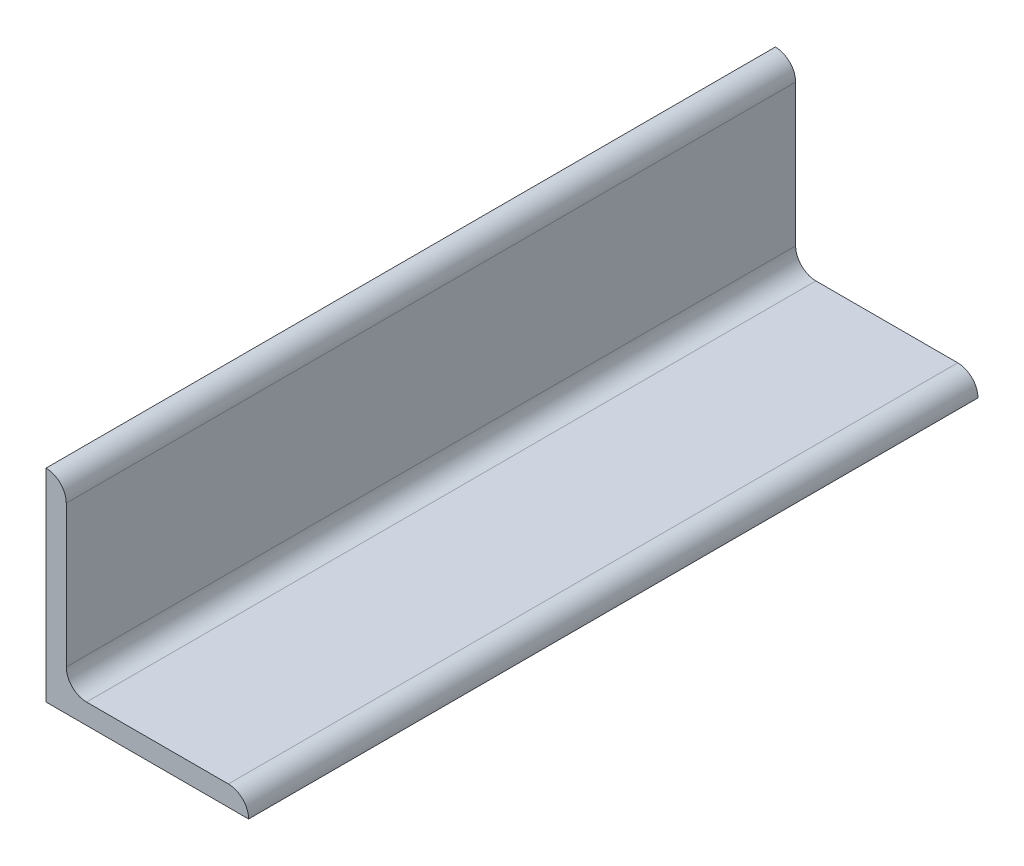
ISO-10303-21;
HEADER;
FILE_DESCRIPTION(('STEP AP214'),'2;1');
FILE_NAME('part.step','',(''),(''),'','','');
FILE_SCHEMA(('AUTOMOTIVE_DESIGN { 1 0 10303 214 1 1 1 1 }'));
ENDSEC;
DATA;
#1=APPLICATION_CONTEXT('core data for automotive mechanical design processes');
#2=APPLICATION_PROTOCOL_DEFINITION('international standard','automotive_design',2000,#1);
#3=PRODUCT_CONTEXT('',#1,'mechanical');
#4=PRODUCT('Part','Part','',(#3));
#5=PRODUCT_RELATED_PRODUCT_CATEGORY('part','',(#4));
#6=PRODUCT_DEFINITION_FORMATION('','',#4);
#7=PRODUCT_DEFINITION_CONTEXT('part definition',#1,'design');
#8=PRODUCT_DEFINITION('design','',#6,#7);
#9=PRODUCT_DEFINITION_SHAPE('','',#8);
#10=(LENGTH_UNIT() NAMED_UNIT(*) SI_UNIT(.MILLI.,.METRE.));
#11=(NAMED_UNIT(*) PLANE_ANGLE_UNIT() SI_UNIT($,.RADIAN.));
#12=(NAMED_UNIT(*) SI_UNIT($,.STERADIAN.) SOLID_ANGLE_UNIT());
#13=UNCERTAINTY_MEASURE_WITH_UNIT(LENGTH_MEASURE(1.E-05),#10,'distance_accuracy_value','');
#14=(GEOMETRIC_REPRESENTATION_CONTEXT(3) GLOBAL_UNCERTAINTY_ASSIGNED_CONTEXT((#13)) GLOBAL_UNIT_ASSIGNED_CONTEXT((#10,
#11,#12)) REPRESENTATION_CONTEXT('',''));
#15=CARTESIAN_POINT('',(0.,0.,0.));
#16=DIRECTION('',(0.,0.,1.));
#17=DIRECTION('',(1.,0.,0.));
#18=AXIS2_PLACEMENT_3D('',#15,#16,#17);
#19=CARTESIAN_POINT('',(50.,0.,90.));
#20=DIRECTION('',(0.,1.,0.));
#21=DIRECTION('',(-1.,0.,0.));
#22=AXIS2_PLACEMENT_3D('',#19,#20,#21);
#23=PLANE('',#22);
#24=DIRECTION('',(1.,0.,0.));
#25=VECTOR('',#24,1.);
#26=CARTESIAN_POINT('',(50.,0.,-90.));
#27=LINE('',#26,#25);
#28=CARTESIAN_POINT('',(0.,0.,-90.));
#29=VERTEX_POINT('',#28);
#30=CARTESIAN_POINT('',(50.,0.,-90.));
#31=VERTEX_POINT('',#30);
#32=EDGE_CURVE('E88',#29,#31,#27,.T.);
#33=ORIENTED_EDGE('',*,*,#32,.T.);
#34=DIRECTION('',(0.,0.,-1.));
#35=VECTOR('',#34,1.);
#36=CARTESIAN_POINT('',(50.,0.,90.));
#37=LINE('',#36,#35);
#38=CARTESIAN_POINT('',(50.,0.,90.));
#39=VERTEX_POINT('',#38);
#40=EDGE_CURVE('E95',#39,#31,#37,.T.);
#41=ORIENTED_EDGE('',*,*,#40,.F.);
#42=DIRECTION('',(1.,0.,0.));
#43=VECTOR('',#42,1.);
#44=CARTESIAN_POINT('',(50.,0.,90.));
#45=LINE('',#44,#43);
#46=CARTESIAN_POINT('',(0.,0.,90.));
#47=VERTEX_POINT('',#46);
#48=EDGE_CURVE('E136',#47,#39,#45,.T.);
#49=ORIENTED_EDGE('',*,*,#48,.F.);
#50=DIRECTION('',(0.,0.,-1.));
#51=VECTOR('',#50,1.);
#52=CARTESIAN_POINT('',(0.,0.,90.));
#53=LINE('',#52,#51);
#54=EDGE_CURVE('E102',#47,#29,#53,.T.);
#55=ORIENTED_EDGE('',*,*,#54,.T.);
#56=EDGE_LOOP('',(#33,#41,#49,#55));
#57=FACE_BOUND('',#56,.T.);
#58=ADVANCED_FACE('F24',(#57),#23,.F.);
#59=CARTESIAN_POINT('',(10.,5.,90.));
#60=DIRECTION('',(0.,-1.,0.));
#61=DIRECTION('',(1.,0.,0.));
#62=AXIS2_PLACEMENT_3D('',#59,#60,#61);
#63=PLANE('',#62);
#64=DIRECTION('',(-1.,0.,0.));
#65=VECTOR('',#64,1.);
#66=CARTESIAN_POINT('',(10.,5.,90.));
#67=LINE('',#66,#65);
#68=CARTESIAN_POINT('',(45.,5.,90.));
#69=VERTEX_POINT('',#68);
#70=CARTESIAN_POINT('',(10.,5.,90.));
#71=VERTEX_POINT('',#70);
#72=EDGE_CURVE('E134',#69,#71,#67,.T.);
#73=ORIENTED_EDGE('',*,*,#72,.F.);
#74=DIRECTION('',(0.,0.,-1.));
#75=VECTOR('',#74,1.);
#76=CARTESIAN_POINT('',(45.,5.,90.));
#77=LINE('',#76,#75);
#78=CARTESIAN_POINT('',(45.,5.,-90.));
#79=VERTEX_POINT('',#78);
#80=EDGE_CURVE('E11',#69,#79,#77,.T.);
#81=ORIENTED_EDGE('',*,*,#80,.T.);
#82=DIRECTION('',(-1.,0.,0.));
#83=VECTOR('',#82,1.);
#84=CARTESIAN_POINT('',(10.,5.,-90.));
#85=LINE('',#84,#83);
#86=CARTESIAN_POINT('',(10.,5.,-90.));
#87=VERTEX_POINT('',#86);
#88=EDGE_CURVE('E90',#79,#87,#85,.T.);
#89=ORIENTED_EDGE('',*,*,#88,.T.);
#90=DIRECTION('',(0.,0.,-1.));
#91=VECTOR('',#90,1.);
#92=CARTESIAN_POINT('',(10.,5.,90.));
#93=LINE('',#92,#91);
#94=EDGE_CURVE('E105',#71,#87,#93,.T.);
#95=ORIENTED_EDGE('',*,*,#94,.F.);
#96=EDGE_LOOP('',(#73,#81,#89,#95));
#97=FACE_BOUND('',#96,.T.);
#98=ADVANCED_FACE('F146',(#97),#63,.F.);
#99=CARTESIAN_POINT('',(10.,9.99999999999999,90.));
#100=DIRECTION('',(0.,0.,-1.));
#101=DIRECTION('',(-1.,0.,0.));
#102=AXIS2_PLACEMENT_3D('',#99,#100,#101);
#103=CYLINDRICAL_SURFACE('',#102,5.);
#104=CARTESIAN_POINT('',(10.,9.99999999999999,-90.));
#105=DIRECTION('',(0.,0.,-1.));
#106=DIRECTION('',(-1.,0.,0.));
#107=AXIS2_PLACEMENT_3D('',#104,#105,#106);
#108=CIRCLE('',#107,5.);
#109=CARTESIAN_POINT('',(5.,9.99999999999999,-90.));
#110=VERTEX_POINT('',#109);
#111=EDGE_CURVE('E142',#87,#110,#108,.T.);
#112=ORIENTED_EDGE('',*,*,#111,.T.);
#113=DIRECTION('',(0.,0.,-1.));
#114=VECTOR('',#113,1.);
#115=CARTESIAN_POINT('',(5.,9.99999999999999,90.));
#116=LINE('',#115,#114);
#117=CARTESIAN_POINT('',(5.,9.99999999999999,90.));
#118=VERTEX_POINT('',#117);
#119=EDGE_CURVE('E108',#118,#110,#116,.T.);
#120=ORIENTED_EDGE('',*,*,#119,.F.);
#121=CARTESIAN_POINT('',(10.,9.99999999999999,90.));
#122=DIRECTION('',(0.,0.,-1.));
#123=DIRECTION('',(-1.,0.,0.));
#124=AXIS2_PLACEMENT_3D('',#121,#122,#123);
#125=CIRCLE('',#124,5.);
#126=EDGE_CURVE('E132',#71,#118,#125,.T.);
#127=ORIENTED_EDGE('',*,*,#126,.F.);
#128=ORIENTED_EDGE('',*,*,#94,.T.);
#129=EDGE_LOOP('',(#112,#120,#127,#128));
#130=FACE_BOUND('',#129,.T.);
#131=ADVANCED_FACE('F149',(#130),#103,.F.);
#132=CARTESIAN_POINT('',(5.,50.,90.));
#133=DIRECTION('',(-1.,0.,0.));
#134=DIRECTION('',(0.,-1.,0.));
#135=AXIS2_PLACEMENT_3D('',#132,#133,#134);
#136=PLANE('',#135);
#137=DIRECTION('',(0.,1.,0.));
#138=VECTOR('',#137,1.);
#139=CARTESIAN_POINT('',(5.,50.,-90.));
#140=LINE('',#139,#138);
#141=CARTESIAN_POINT('',(5.,45.,-90.));
#142=VERTEX_POINT('',#141);
#143=EDGE_CURVE('E140',#110,#142,#140,.T.);
#144=ORIENTED_EDGE('',*,*,#143,.T.);
#145=DIRECTION('',(0.,0.,-1.));
#146=VECTOR('',#145,1.);
#147=CARTESIAN_POINT('',(5.,45.,90.));
#148=LINE('',#147,#146);
#149=CARTESIAN_POINT('',(5.,45.,90.));
#150=VERTEX_POINT('',#149);
#151=EDGE_CURVE('E46',#142,#150,#148,.F.);
#152=ORIENTED_EDGE('',*,*,#151,.T.);
#153=DIRECTION('',(0.,1.,0.));
#154=VECTOR('',#153,1.);
#155=CARTESIAN_POINT('',(5.,50.,90.));
#156=LINE('',#155,#154);
#157=EDGE_CURVE('E118',#118,#150,#156,.T.);
#158=ORIENTED_EDGE('',*,*,#157,.F.);
#159=ORIENTED_EDGE('',*,*,#119,.T.);
#160=EDGE_LOOP('',(#144,#152,#158,#159));
#161=FACE_BOUND('',#160,.T.);
#162=ADVANCED_FACE('F152',(#161),#136,.F.);
#163=CARTESIAN_POINT('',(0.,50.,90.));
#164=DIRECTION('',(1.,0.,0.));
#165=DIRECTION('',(0.,1.,0.));
#166=AXIS2_PLACEMENT_3D('',#163,#164,#165);
#167=PLANE('',#166);
#168=DIRECTION('',(0.,-1.,0.));
#169=VECTOR('',#168,1.);
#170=CARTESIAN_POINT('',(0.,50.,-90.));
#171=LINE('',#170,#169);
#172=CARTESIAN_POINT('',(0.,50.,-90.));
#173=VERTEX_POINT('',#172);
#174=EDGE_CURVE('E138',#173,#29,#171,.T.);
#175=ORIENTED_EDGE('',*,*,#174,.T.);
#176=ORIENTED_EDGE('',*,*,#54,.F.);
#177=DIRECTION('',(0.,-1.,0.));
#178=VECTOR('',#177,1.);
#179=CARTESIAN_POINT('',(0.,50.,90.));
#180=LINE('',#179,#178);
#181=CARTESIAN_POINT('',(0.,50.,90.));
#182=VERTEX_POINT('',#181);
#183=EDGE_CURVE('E117',#182,#47,#180,.T.);
#184=ORIENTED_EDGE('',*,*,#183,.F.);
#185=DIRECTION('',(0.,0.,-1.));
#186=VECTOR('',#185,1.);
#187=CARTESIAN_POINT('',(0.,50.,90.));
#188=LINE('',#187,#186);
#189=EDGE_CURVE('E124',#182,#173,#188,.T.);
#190=ORIENTED_EDGE('',*,*,#189,.T.);
#191=EDGE_LOOP('',(#175,#176,#184,#190));
#192=FACE_BOUND('',#191,.T.);
#193=ADVANCED_FACE('F123',(#192),#167,.F.);
#194=CARTESIAN_POINT('',(10.,9.99999999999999,90.));
#195=DIRECTION('',(0.,0.,-1.));
#196=DIRECTION('',(-1.,0.,0.));
#197=AXIS2_PLACEMENT_3D('',#194,#195,#196);
#198=PLANE('',#197);
#199=ORIENTED_EDGE('',*,*,#157,.T.);
#200=CARTESIAN_POINT('',(0.,45.,90.));
#201=DIRECTION('',(0.,0.,-1.));
#202=DIRECTION('',(-1.,0.,0.));
#203=AXIS2_PLACEMENT_3D('',#200,#201,#202);
#204=CIRCLE('',#203,5.);
#205=EDGE_CURVE('E31',#150,#182,#204,.F.);
#206=ORIENTED_EDGE('',*,*,#205,.T.);
#207=ORIENTED_EDGE('',*,*,#183,.T.);
#208=ORIENTED_EDGE('',*,*,#48,.T.);
#209=CARTESIAN_POINT('',(45.,0.,90.));
#210=DIRECTION('',(0.,0.,-1.));
#211=DIRECTION('',(-1.,0.,0.));
#212=AXIS2_PLACEMENT_3D('',#209,#210,#211);
#213=CIRCLE('',#212,5.);
#214=EDGE_CURVE('E38',#39,#69,#213,.F.);
#215=ORIENTED_EDGE('',*,*,#214,.T.);
#216=ORIENTED_EDGE('',*,*,#72,.T.);
#217=ORIENTED_EDGE('',*,*,#126,.T.);
#218=EDGE_LOOP('',(#199,#206,#207,#208,#215,#216,#217));
#219=FACE_BOUND('',#218,.T.);
#220=ADVANCED_FACE('F116',(#219),#198,.F.);
#221=CARTESIAN_POINT('',(10.,9.99999999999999,-90.));
#222=DIRECTION('',(0.,0.,-1.));
#223=DIRECTION('',(-1.,0.,0.));
#224=AXIS2_PLACEMENT_3D('',#221,#222,#223);
#225=PLANE('',#224);
#226=ORIENTED_EDGE('',*,*,#174,.F.);
#227=CARTESIAN_POINT('',(0.,45.,-90.));
#228=DIRECTION('',(0.,0.,-1.));
#229=DIRECTION('',(-1.,0.,0.));
#230=AXIS2_PLACEMENT_3D('',#227,#228,#229);
#231=CIRCLE('',#230,5.);
#232=EDGE_CURVE('E94',#173,#142,#231,.T.);
#233=ORIENTED_EDGE('',*,*,#232,.T.);
#234=ORIENTED_EDGE('',*,*,#143,.F.);
#235=ORIENTED_EDGE('',*,*,#111,.F.);
#236=ORIENTED_EDGE('',*,*,#88,.F.);
#237=CARTESIAN_POINT('',(45.,0.,-90.));
#238=DIRECTION('',(0.,0.,-1.));
#239=DIRECTION('',(-1.,0.,0.));
#240=AXIS2_PLACEMENT_3D('',#237,#238,#239);
#241=CIRCLE('',#240,5.);
#242=EDGE_CURVE('E84',#79,#31,#241,.T.);
#243=ORIENTED_EDGE('',*,*,#242,.T.);
#244=ORIENTED_EDGE('',*,*,#32,.F.);
#245=EDGE_LOOP('',(#226,#233,#234,#235,#236,#243,#244));
#246=FACE_BOUND('',#245,.T.);
#247=ADVANCED_FACE('F87',(#246),#225,.T.);
#248=CARTESIAN_POINT('',(0.,45.,90.));
#249=DIRECTION('',(0.,0.,-1.));
#250=DIRECTION('',(-1.,0.,0.));
#251=AXIS2_PLACEMENT_3D('',#248,#249,#250);
#252=CYLINDRICAL_SURFACE('',#251,5.);
#253=ORIENTED_EDGE('',*,*,#205,.F.);
#254=ORIENTED_EDGE('',*,*,#151,.F.);
#255=ORIENTED_EDGE('',*,*,#232,.F.);
#256=ORIENTED_EDGE('',*,*,#189,.F.);
#257=EDGE_LOOP('',(#253,#254,#255,#256));
#258=FACE_BOUND('',#257,.T.);
#259=ADVANCED_FACE('F126',(#258),#252,.T.);
#260=CARTESIAN_POINT('',(45.,0.,90.));
#261=DIRECTION('',(0.,0.,-1.));
#262=DIRECTION('',(-1.,0.,0.));
#263=AXIS2_PLACEMENT_3D('',#260,#261,#262);
#264=CYLINDRICAL_SURFACE('',#263,5.);
#265=ORIENTED_EDGE('',*,*,#214,.F.);
#266=ORIENTED_EDGE('',*,*,#40,.T.);
#267=ORIENTED_EDGE('',*,*,#242,.F.);
#268=ORIENTED_EDGE('',*,*,#80,.F.);
#269=EDGE_LOOP('',(#265,#266,#267,#268));
#270=FACE_BOUND('',#269,.T.);
#271=ADVANCED_FACE('F104',(#270),#264,.T.);
#272=CLOSED_SHELL('',(#58,#98,#131,#162,#193,#220,#247,#259,#271));
#273=MANIFOLD_SOLID_BREP('B2',#272);
#274=ADVANCED_BREP_SHAPE_REPRESENTATION('',(#18,#273),#14);
#275=SHAPE_DEFINITION_REPRESENTATION(#9,#274);
ENDSEC;
END-ISO-10303-21;
